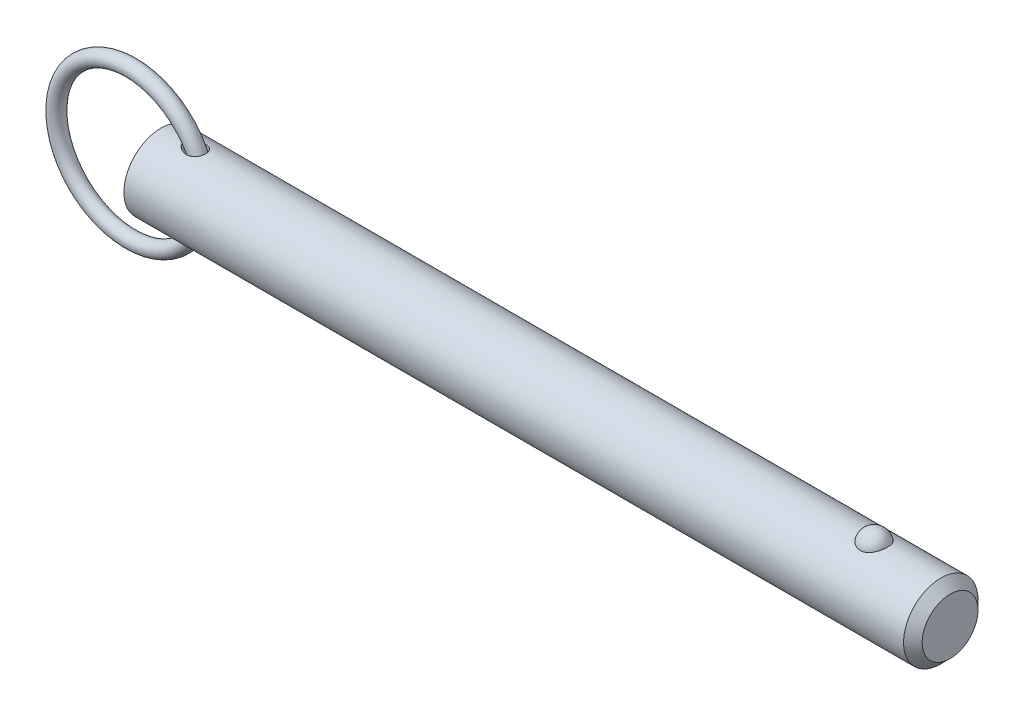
ISO-10303-21;
HEADER;
FILE_DESCRIPTION(('STEP AP214'),'2;1');
FILE_NAME('part.step','',(''),(''),'','','');
FILE_SCHEMA(('AUTOMOTIVE_DESIGN { 1 0 10303 214 1 1 1 1 }'));
ENDSEC;
DATA;
#1=APPLICATION_CONTEXT('core data for automotive mechanical design processes');
#2=APPLICATION_PROTOCOL_DEFINITION('international standard','automotive_design',2000,#1);
#3=PRODUCT_CONTEXT('',#1,'mechanical');
#4=PRODUCT('Part','Part','',(#3));
#5=PRODUCT_RELATED_PRODUCT_CATEGORY('part','',(#4));
#6=PRODUCT_DEFINITION_FORMATION('','',#4);
#7=PRODUCT_DEFINITION_CONTEXT('part definition',#1,'design');
#8=PRODUCT_DEFINITION('design','',#6,#7);
#9=PRODUCT_DEFINITION_SHAPE('','',#8);
#10=(LENGTH_UNIT() NAMED_UNIT(*) SI_UNIT(.MILLI.,.METRE.));
#11=(NAMED_UNIT(*) PLANE_ANGLE_UNIT() SI_UNIT($,.RADIAN.));
#12=(NAMED_UNIT(*) SI_UNIT($,.STERADIAN.) SOLID_ANGLE_UNIT());
#13=UNCERTAINTY_MEASURE_WITH_UNIT(LENGTH_MEASURE(1.E-05),#10,'distance_accuracy_value','');
#14=(GEOMETRIC_REPRESENTATION_CONTEXT(3) GLOBAL_UNCERTAINTY_ASSIGNED_CONTEXT((#13)) GLOBAL_UNIT_ASSIGNED_CONTEXT((#10,
#11,#12)) REPRESENTATION_CONTEXT('',''));
#15=CARTESIAN_POINT('',(0.,0.,0.));
#16=DIRECTION('',(0.,0.,1.));
#17=DIRECTION('',(1.,0.,0.));
#18=AXIS2_PLACEMENT_3D('',#15,#16,#17);
#19=CARTESIAN_POINT('',(-6.46799987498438,0.,0.));
#20=DIRECTION('',(0.,0.,1.));
#21=DIRECTION('',(1.,0.,0.));
#22=AXIS2_PLACEMENT_3D('',#19,#20,#21);
#23=TOROIDAL_SURFACE('',#22,15.875,1.588);
#24=CARTESIAN_POINT('',(10.9950001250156,0.,0.));
#25=VERTEX_POINT('',#24);
#26=VERTEX_LOOP('',#25);
#27=FACE_BOUND('',#26,.T.);
#28=ADVANCED_FACE('P0_F12',(#27),#23,.T.);
#29=CLOSED_SHELL('',(#28));
#30=MANIFOLD_SOLID_BREP('P0_B1',#29);
#31=CARTESIAN_POINT('',(0.,0.,0.));
#32=DIRECTION('',(1.,0.,0.));
#33=DIRECTION('',(0.,0.,-1.));
#34=AXIS2_PLACEMENT_3D('',#31,#32,#33);
#35=CYLINDRICAL_SURFACE('',#34,7.94);
#36=CARTESIAN_POINT('',(5.37881269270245,7.8641200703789,-1.0950869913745));
#37=CARTESIAN_POINT('',(5.49078530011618,7.84653010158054,-1.22142628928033));
#38=CARTESIAN_POINT('',(5.61742164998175,7.82766483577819,-1.33478448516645));
#39=CARTESIAN_POINT('',(5.82155225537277,7.80005811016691,-1.48501770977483));
#40=CARTESIAN_POINT('',(5.89211597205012,7.79095331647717,-1.53186949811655));
#41=CARTESIAN_POINT('',(6.03726296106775,7.77331484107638,-1.61899652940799));
#42=CARTESIAN_POINT('',(6.11184478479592,7.76478095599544,-1.65927412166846));
#43=CARTESIAN_POINT('',(6.31831542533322,7.74290334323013,-1.75933205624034));
#44=CARTESIAN_POINT('',(6.45343253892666,7.73042593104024,-1.81276183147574));
#45=CARTESIAN_POINT('',(6.73017339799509,7.70966096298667,-1.89912673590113));
#46=CARTESIAN_POINT('',(6.87179099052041,7.70136953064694,-1.93208083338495));
#47=CARTESIAN_POINT('',(7.17522096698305,7.6896684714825,-1.97820987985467));
#48=CARTESIAN_POINT('',(7.33750100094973,7.68691980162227,-1.98871513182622));
#49=CARTESIAN_POINT('',(7.57994245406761,7.68880305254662,-1.98137951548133));
#50=CARTESIAN_POINT('',(7.66059155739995,7.69043175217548,-1.97508575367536));
#51=CARTESIAN_POINT('',(7.82077465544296,7.69570110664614,-1.95445819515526));
#52=CARTESIAN_POINT('',(7.9003091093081,7.69934090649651,-1.94012781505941));
#53=CARTESIAN_POINT('',(8.09280087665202,7.71066069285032,-1.89475688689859));
#54=CARTESIAN_POINT('',(8.20465204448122,7.71942251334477,-1.85909462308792));
#55=CARTESIAN_POINT('',(8.42059371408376,7.74035594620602,-1.7699066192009));
#56=CARTESIAN_POINT('',(8.52468939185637,7.75252525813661,-1.7163929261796));
#57=CARTESIAN_POINT('',(8.72211003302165,7.77903750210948,-1.59192358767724));
#58=CARTESIAN_POINT('',(8.81539818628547,7.79338749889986,-1.52091076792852));
#59=CARTESIAN_POINT('',(8.98759177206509,7.8225086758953,-1.36321590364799));
#60=CARTESIAN_POINT('',(9.06649712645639,7.83727985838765,-1.27653377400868));
#61=CARTESIAN_POINT('',(9.20311499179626,7.86453692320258,-1.09567667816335));
#62=CARTESIAN_POINT('',(9.26180839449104,7.8771064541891,-1.00225329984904));
#63=CARTESIAN_POINT('',(9.36257622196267,7.89954213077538,-0.8065472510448));
#64=CARTESIAN_POINT('',(9.40465301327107,7.9094086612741,-0.704265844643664));
#65=CARTESIAN_POINT('',(9.47062404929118,7.92520709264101,-0.495461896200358));
#66=CARTESIAN_POINT('',(9.49478817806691,7.9311972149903,-0.389028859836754));
#67=CARTESIAN_POINT('',(9.52544004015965,7.93883641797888,-0.173494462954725));
#68=CARTESIAN_POINT('',(9.5319278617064,7.94048552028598,-0.0643931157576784));
#69=CARTESIAN_POINT('',(9.52707996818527,7.93926454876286,0.153487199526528));
#70=CARTESIAN_POINT('',(9.51572796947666,7.93639034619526,0.26226578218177));
#71=CARTESIAN_POINT('',(9.47542322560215,7.92642470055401,0.476313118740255));
#72=CARTESIAN_POINT('',(9.44647056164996,7.91933327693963,0.581581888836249));
#73=CARTESIAN_POINT('',(9.3716401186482,7.90170355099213,0.785602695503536));
#74=CARTESIAN_POINT('',(9.32576415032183,7.89116561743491,0.884355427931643));
#75=CARTESIAN_POINT('',(9.21823065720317,7.8677977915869,1.07254831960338));
#76=CARTESIAN_POINT('',(9.15657431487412,7.85496807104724,1.16198917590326));
#77=CARTESIAN_POINT('',(9.01919194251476,7.82843688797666,1.32903649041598));
#78=CARTESIAN_POINT('',(8.94347744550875,7.81473614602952,1.40665255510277));
#79=CARTESIAN_POINT('',(8.78012086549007,7.7879321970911,1.5481977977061));
#80=CARTESIAN_POINT('',(8.69247914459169,7.77482897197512,1.61212739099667));
#81=CARTESIAN_POINT('',(8.50642314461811,7.75037063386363,1.72592270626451));
#82=CARTESIAN_POINT('',(8.40786430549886,7.73904540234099,1.77555777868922));
#83=CARTESIAN_POINT('',(8.2039870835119,7.71943979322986,1.85894844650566));
#84=CARTESIAN_POINT('',(8.0986670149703,7.7111601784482,1.89270006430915));
#85=CARTESIAN_POINT('',(7.87703213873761,7.69782475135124,1.94625652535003));
#86=CARTESIAN_POINT('',(7.76044899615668,7.69301557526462,1.96500324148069));
#87=CARTESIAN_POINT('',(7.52574256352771,7.68770484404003,1.98567257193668));
#88=CARTESIAN_POINT('',(7.40761868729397,7.68720497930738,1.98758858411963));
#89=CARTESIAN_POINT('',(7.15639592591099,7.69044495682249,1.97502233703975));
#90=CARTESIAN_POINT('',(7.02341871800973,7.69476380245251,1.9583009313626));
#91=CARTESIAN_POINT('',(6.7612589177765,7.70776394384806,1.90648094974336));
#92=CARTESIAN_POINT('',(6.6320804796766,7.71644984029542,1.87136299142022));
#93=CARTESIAN_POINT('',(6.35978215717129,7.73875442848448,1.77707737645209));
#94=CARTESIAN_POINT('',(6.2177212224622,7.75293863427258,1.71496895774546));
#95=CARTESIAN_POINT('',(5.94559201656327,7.78383102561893,1.56880760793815));
#96=CARTESIAN_POINT('',(5.81552062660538,7.80053855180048,1.48476040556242));
#97=CARTESIAN_POINT('',(5.60081087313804,7.83035955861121,1.31701356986));
#98=CARTESIAN_POINT('',(5.51265224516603,7.84340226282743,1.23780647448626));
#99=CARTESIAN_POINT('',(5.34976240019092,7.86852524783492,1.06647953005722));
#100=CARTESIAN_POINT('',(5.27500719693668,7.88060722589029,0.974383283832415));
#101=CARTESIAN_POINT('',(5.15877594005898,7.89990441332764,0.800548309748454));
#102=CARTESIAN_POINT('',(5.11360209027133,7.90759876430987,0.721348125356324));
#103=CARTESIAN_POINT('',(5.03655060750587,7.92090267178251,0.556518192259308));
#104=CARTESIAN_POINT('',(5.00466157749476,7.92651401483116,0.470894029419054));
#105=CARTESIAN_POINT('',(4.95653766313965,7.93503671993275,0.294356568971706));
#106=CARTESIAN_POINT('',(4.94043621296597,7.93792505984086,0.203404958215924));
#107=CARTESIAN_POINT('',(4.92605720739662,7.94050250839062,0.0200631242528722));
#108=CARTESIAN_POINT('',(4.92776929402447,7.9401934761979,-0.072326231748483));
#109=CARTESIAN_POINT('',(4.94742735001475,7.93667454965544,-0.24325091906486));
#110=CARTESIAN_POINT('',(4.96327131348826,7.93384031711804,-0.32204819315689));
#111=CARTESIAN_POINT('',(5.00707570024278,7.92609115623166,-0.47605810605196));
#112=CARTESIAN_POINT('',(5.0350396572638,7.92117562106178,-0.551269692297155));
#113=CARTESIAN_POINT('',(5.10737112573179,7.90866290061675,-0.70999547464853));
#114=CARTESIAN_POINT('',(5.15379379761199,7.90074105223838,-0.792541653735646));
#115=CARTESIAN_POINT('',(5.2582083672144,7.88338732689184,-0.949781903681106));
#116=CARTESIAN_POINT('',(5.31621941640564,7.87395295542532,-1.02446265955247));
#117=CARTESIAN_POINT('',(5.37881269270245,7.8641200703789,-1.0950869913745));
#118=B_SPLINE_CURVE_WITH_KNOTS('',3,(#36,#37,#38,#39,#40,#41,#42,#43,#44,#45,#46,#47,#48,#49,
#50,#51,#52,#53,#54,#55,#56,#57,#58,#59,#60,#61,#62,#63,#64,#65,#66,#67,#68,#69,#70,#71,#72,#73,
#74,#75,#76,#77,#78,#79,#80,#81,#82,#83,#84,#85,#86,#87,#88,#89,#90,#91,#92,#93,#94,#95,#96,#97,
#98,#99,#100,#101,#102,#103,#104,#105,#106,#107,#108,#109,#110,#111,#112,#113,#114,#115,#116,
#117),.UNSPECIFIED.,.T.,.F.,(4,2,2,2,2,2,2,2,2,2,2,2,2,2,2,2,2,2,2,2,2,2,2,2,2,2,2,2,2,2,2,2,2,
2,2,2,2,2,2,2,4),(0.,0.508599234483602,0.763935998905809,1.01918131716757,1.45492798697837,
1.89027038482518,2.37502798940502,2.61739702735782,2.8596631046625,3.21120678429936,
3.56251370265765,3.91498401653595,4.26745624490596,4.59897839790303,4.93045331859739,
5.2568264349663,5.58319792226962,5.909867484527,6.23653553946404,6.56316865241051,
6.88977729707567,7.21611917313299,7.54245114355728,7.87378632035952,8.20520442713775,
8.55832700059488,8.91158808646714,9.31234018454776,9.71351536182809,10.1786231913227,
10.6436096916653,11.0001264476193,11.3559986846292,11.6294791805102,11.9027245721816,
12.1782599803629,12.4536351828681,12.693828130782,12.9340911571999,13.2179277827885,
13.5022374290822),.UNSPECIFIED.);
#119=CARTESIAN_POINT('',(5.37881269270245,7.8641200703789,-1.0950869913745));
#120=VERTEX_POINT('',#119);
#121=EDGE_CURVE('P1_E40',#120,#120,#118,.T.);
#122=ORIENTED_EDGE('',*,*,#121,.T.);
#123=EDGE_LOOP('',(#122));
#124=FACE_BOUND('',#123,.T.);
#125=CARTESIAN_POINT('',(166.295,0.,0.));
#126=DIRECTION('',(1.,0.,0.));
#127=DIRECTION('',(0.,0.,-1.));
#128=AXIS2_PLACEMENT_3D('',#125,#126,#127);
#129=CIRCLE('',#128,7.94);
#130=CARTESIAN_POINT('',(166.295,0.,-7.94));
#131=VERTEX_POINT('',#130);
#132=EDGE_CURVE('P1_E25',#131,#131,#129,.T.);
#133=ORIENTED_EDGE('',*,*,#132,.F.);
#134=EDGE_LOOP('',(#133));
#135=FACE_BOUND('',#134,.T.);
#136=CARTESIAN_POINT('',(0.,0.,0.));
#137=DIRECTION('',(1.,0.,0.));
#138=DIRECTION('',(0.,0.,-1.));
#139=AXIS2_PLACEMENT_3D('',#136,#137,#138);
#140=CIRCLE('',#139,7.94);
#141=CARTESIAN_POINT('',(0.,0.,-7.94));
#142=VERTEX_POINT('',#141);
#143=EDGE_CURVE('P1_E9',#142,#142,#140,.T.);
#144=ORIENTED_EDGE('',*,*,#143,.T.);
#145=EDGE_LOOP('',(#144));
#146=FACE_BOUND('',#145,.T.);
#147=CARTESIAN_POINT('',(152.064907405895,7.37767842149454,2.93486986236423));
#148=CARTESIAN_POINT('',(151.912749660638,7.3776732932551,2.93487505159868));
#149=CARTESIAN_POINT('',(151.760632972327,7.38258419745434,2.92262454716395));
#150=CARTESIAN_POINT('',(151.460928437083,7.40163229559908,2.87404196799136));
#151=CARTESIAN_POINT('',(151.313339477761,7.41576720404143,2.83771585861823));
#152=CARTESIAN_POINT('',(151.027018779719,7.45161576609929,2.74218769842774));
#153=CARTESIAN_POINT('',(150.888274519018,7.47331841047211,2.68301886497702));
#154=CARTESIAN_POINT('',(150.622882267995,7.52194082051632,2.54350967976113));
#155=CARTESIAN_POINT('',(150.496236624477,7.54886159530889,2.46316523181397));
#156=CARTESIAN_POINT('',(150.254534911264,7.60594671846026,2.28090375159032));
#157=CARTESIAN_POINT('',(150.139906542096,7.63618114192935,2.1784421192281));
#158=CARTESIAN_POINT('',(149.928878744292,7.69614046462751,1.95608495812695));
#159=CARTESIAN_POINT('',(149.832482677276,7.72586526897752,1.83618622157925));
#160=CARTESIAN_POINT('',(149.655938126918,7.78314821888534,1.57628086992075));
#161=CARTESIAN_POINT('',(149.576707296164,7.81055035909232,1.43561546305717));
#162=CARTESIAN_POINT('',(149.441797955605,7.85879631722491,1.142363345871));
#163=CARTESIAN_POINT('',(149.386121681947,7.87963951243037,0.989775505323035));
#164=CARTESIAN_POINT('',(149.29881215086,7.91289645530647,0.674619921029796));
#165=CARTESIAN_POINT('',(149.26753090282,7.92518652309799,0.511941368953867));
#166=CARTESIAN_POINT('',(149.230975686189,7.93958930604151,0.18324773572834));
#167=CARTESIAN_POINT('',(149.225701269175,7.94170219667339,0.017232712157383));
#168=CARTESIAN_POINT('',(149.241231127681,7.93554931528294,-0.31267286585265));
#169=CARTESIAN_POINT('',(149.261925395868,7.92732732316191,-0.476569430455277));
#170=CARTESIAN_POINT('',(149.32878655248,7.90141534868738,-0.798305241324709));
#171=CARTESIAN_POINT('',(149.374953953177,7.88372517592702,-0.956144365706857));
#172=CARTESIAN_POINT('',(149.491898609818,7.84066230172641,-1.26152073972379));
#173=CARTESIAN_POINT('',(149.562704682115,7.81528060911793,-1.40904568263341));
#174=CARTESIAN_POINT('',(149.727478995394,7.75948672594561,-1.68950598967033));
#175=CARTESIAN_POINT('',(149.821448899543,7.72907417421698,-1.82244030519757));
#176=CARTESIAN_POINT('',(150.030839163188,7.66640424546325,-2.07032792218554));
#177=CARTESIAN_POINT('',(150.146315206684,7.63414223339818,-2.18523308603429));
#178=CARTESIAN_POINT('',(150.3959006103,7.57149681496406,-2.39329737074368));
#179=CARTESIAN_POINT('',(150.530008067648,7.54111321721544,-2.48645870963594));
#180=CARTESIAN_POINT('',(150.810111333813,7.48650742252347,-2.64628132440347));
#181=CARTESIAN_POINT('',(150.955760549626,7.46215900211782,-2.71350554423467));
#182=CARTESIAN_POINT('',(151.257425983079,7.42171253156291,-2.82226614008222));
#183=CARTESIAN_POINT('',(151.413438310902,7.40561140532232,-2.86381209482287));
#184=CARTESIAN_POINT('',(151.722970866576,7.3842679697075,-2.9183907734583));
#185=CARTESIAN_POINT('',(151.876222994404,7.37852109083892,-2.93275024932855));
#186=CARTESIAN_POINT('',(152.183070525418,7.37700973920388,-2.93655208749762));
#187=CARTESIAN_POINT('',(152.336665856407,7.38124333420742,-2.92599927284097));
#188=CARTESIAN_POINT('',(152.634990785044,7.39890635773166,-2.88102897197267));
#189=CARTESIAN_POINT('',(152.779848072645,7.41205491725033,-2.84733999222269));
#190=CARTESIAN_POINT('',(153.06164329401,7.445801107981,-2.75788206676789));
#191=CARTESIAN_POINT('',(153.198580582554,7.46639934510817,-2.70211132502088));
#192=CARTESIAN_POINT('',(153.464061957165,7.51339098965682,-2.56858908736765));
#193=CARTESIAN_POINT('',(153.592354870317,7.53990200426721,-2.4903806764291));
#194=CARTESIAN_POINT('',(153.834244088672,7.59569503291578,-2.31462737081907));
#195=CARTESIAN_POINT('',(153.947837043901,7.6249776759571,-2.21707808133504));
#196=CARTESIAN_POINT('',(154.16322156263,7.68489473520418,-1.99982049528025));
#197=CARTESIAN_POINT('',(154.264148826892,7.71552419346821,-1.87925337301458));
#198=CARTESIAN_POINT('',(154.445186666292,7.77353016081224,-1.6226882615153));
#199=CARTESIAN_POINT('',(154.525293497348,7.80090608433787,-1.48668750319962));
#200=CARTESIAN_POINT('',(154.665361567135,7.85047992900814,-1.1981841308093));
#201=CARTESIAN_POINT('',(154.724587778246,7.87248183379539,-1.04529016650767));
#202=CARTESIAN_POINT('',(154.817982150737,7.90785114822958,-0.731080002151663));
#203=CARTESIAN_POINT('',(154.852149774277,7.92121837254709,-0.56976362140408));
#204=CARTESIAN_POINT('',(154.894795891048,7.93797834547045,-0.242812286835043));
#205=CARTESIAN_POINT('',(154.903204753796,7.94134405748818,-0.0771668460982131));
#206=CARTESIAN_POINT('',(154.893962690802,7.93767937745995,0.253276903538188));
#207=CARTESIAN_POINT('',(154.876312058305,7.93064910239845,0.418075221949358));
#208=CARTESIAN_POINT('',(154.815424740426,7.90695571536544,0.741525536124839));
#209=CARTESIAN_POINT('',(154.772281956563,7.8903279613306,0.900197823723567));
#210=CARTESIAN_POINT('',(154.66135358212,7.84916386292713,1.20759654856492));
#211=CARTESIAN_POINT('',(154.59356656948,7.82462706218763,1.35632241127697));
#212=CARTESIAN_POINT('',(154.434371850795,7.7700669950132,1.64032869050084));
#213=CARTESIAN_POINT('',(154.342861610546,7.7400200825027,1.7755471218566));
#214=CARTESIAN_POINT('',(154.138296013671,7.67774175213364,2.0280064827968));
#215=CARTESIAN_POINT('',(154.025241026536,7.64551037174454,2.14524772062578));
#216=CARTESIAN_POINT('',(153.780831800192,7.58265895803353,2.35778002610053));
#217=CARTESIAN_POINT('',(153.649583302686,7.5520309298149,2.45319004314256));
#218=CARTESIAN_POINT('',(153.371601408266,7.49579792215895,2.61999897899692));
#219=CARTESIAN_POINT('',(153.224867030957,7.47019326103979,2.69139637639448));
#220=CARTESIAN_POINT('',(152.912947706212,7.42622216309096,2.8105324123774));
#221=CARTESIAN_POINT('',(152.747220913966,7.40825002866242,2.85700910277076));
#222=CARTESIAN_POINT('',(152.409279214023,7.38398348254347,2.9191685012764));
#223=CARTESIAN_POINT('',(152.23706702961,7.3776842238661,2.93486399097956));
#224=CARTESIAN_POINT('',(152.064907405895,7.37767842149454,2.93486986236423));
#225=B_SPLINE_CURVE_WITH_KNOTS('',3,(#147,#148,#149,#150,#151,#152,#153,#154,#155,#156,#157,
#158,#159,#160,#161,#162,#163,#164,#165,#166,#167,#168,#169,#170,#171,#172,#173,#174,#175,#176,
#177,#178,#179,#180,#181,#182,#183,#184,#185,#186,#187,#188,#189,#190,#191,#192,#193,#194,#195,
#196,#197,#198,#199,#200,#201,#202,#203,#204,#205,#206,#207,#208,#209,#210,#211,#212,#213,#214,
#215,#216,#217,#218,#219,#220,#221,#222,#223,#224),.UNSPECIFIED.,.T.,.F.,(4,2,2,2,2,2,2,2,2,2,2,
2,2,2,2,2,2,2,2,2,2,2,2,2,2,2,2,2,2,2,2,2,2,2,2,2,2,2,4),(0.,0.455841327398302,
0.911569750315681,1.36663794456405,1.82179423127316,2.28978983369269,2.75787163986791,
3.24685368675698,3.73588214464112,4.23184282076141,4.72779494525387,5.22165321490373,
5.71552141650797,6.2099691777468,6.7044524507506,7.20023431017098,7.69596557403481,
8.18023418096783,8.66432203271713,9.1241069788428,9.58380291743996,10.0296503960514,
10.4755341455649,10.9312349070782,11.3870393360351,11.8654416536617,12.3439299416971,
12.8378875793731,13.3318558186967,13.8271581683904,14.3224549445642,14.8159385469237,
15.3094506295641,15.8051323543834,16.3008055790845,16.7937101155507,17.2866458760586,
17.8026240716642,18.3183879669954),.UNSPECIFIED.);
#226=CARTESIAN_POINT('',(152.064907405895,7.37767842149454,2.93486986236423));
#227=VERTEX_POINT('',#226);
#228=EDGE_CURVE('P1_E34',#227,#227,#225,.T.);
#229=ORIENTED_EDGE('',*,*,#228,.T.);
#230=EDGE_LOOP('',(#229));
#231=FACE_BOUND('',#230,.T.);
#232=CARTESIAN_POINT('',(5.37881269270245,-7.8641200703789,-1.0950869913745));
#233=CARTESIAN_POINT('',(5.31532711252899,-7.87409326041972,-1.02345575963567));
#234=CARTESIAN_POINT('',(5.25654962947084,-7.88365715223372,-0.947641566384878));
#235=CARTESIAN_POINT('',(5.15093536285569,-7.90122221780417,-0.787865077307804));
#236=CARTESIAN_POINT('',(5.10408931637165,-7.90922460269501,-0.703909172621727));
#237=CARTESIAN_POINT('',(5.02499142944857,-7.92292057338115,-0.527991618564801));
#238=CARTESIAN_POINT('',(4.99290048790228,-7.92858863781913,-0.435954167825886));
#239=CARTESIAN_POINT('',(4.94718343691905,-7.93670712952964,-0.247266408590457));
#240=CARTESIAN_POINT('',(4.93353142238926,-7.93916207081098,-0.150622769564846));
#241=CARTESIAN_POINT('',(4.92669426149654,-7.94038957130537,0.0306459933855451));
#242=CARTESIAN_POINT('',(4.93105622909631,-7.93960347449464,0.115182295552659));
#243=CARTESIAN_POINT('',(4.95441758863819,-7.93542535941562,0.282133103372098));
#244=CARTESIAN_POINT('',(4.97342060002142,-7.93203269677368,0.364547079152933));
#245=CARTESIAN_POINT('',(5.02337664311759,-7.92322764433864,0.521528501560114));
#246=CARTESIAN_POINT('',(5.05377582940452,-7.91790920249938,0.596281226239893));
#247=CARTESIAN_POINT('',(5.1246872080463,-7.90571364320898,0.740640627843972));
#248=CARTESIAN_POINT('',(5.16520358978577,-7.89883588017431,0.81024515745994));
#249=CARTESIAN_POINT('',(5.27792634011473,-7.88012470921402,0.978620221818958));
#250=CARTESIAN_POINT('',(5.35563200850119,-7.86757912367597,1.07363778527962));
#251=CARTESIAN_POINT('',(5.52523836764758,-7.84150676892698,1.24994147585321));
#252=CARTESIAN_POINT('',(5.61717506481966,-7.82797755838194,1.33119164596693));
#253=CARTESIAN_POINT('',(5.8391371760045,-7.79742756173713,1.50104748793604));
#254=CARTESIAN_POINT('',(5.9725742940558,-7.78050347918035,1.58521567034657));
#255=CARTESIAN_POINT('',(6.25160600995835,-7.74942135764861,1.73078109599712));
#256=CARTESIAN_POINT('',(6.39720857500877,-7.73526515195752,1.79216327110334));
#257=CARTESIAN_POINT('',(6.69793322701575,-7.7116170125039,1.89134478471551));
#258=CARTESIAN_POINT('',(6.85312134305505,-7.70216275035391,1.92895428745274));
#259=CARTESIAN_POINT('',(7.16781951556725,-7.68988337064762,1.97736316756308));
#260=CARTESIAN_POINT('',(7.32732244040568,-7.68704791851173,1.98820434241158));
#261=CARTESIAN_POINT('',(7.61290770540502,-7.68890797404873,1.98097687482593));
#262=CARTESIAN_POINT('',(7.73913797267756,-7.69217875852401,1.96837928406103));
#263=CARTESIAN_POINT('',(7.98774248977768,-7.70364253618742,1.92303262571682));
#264=CARTESIAN_POINT('',(8.11011880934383,-7.71183283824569,1.89029457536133));
#265=CARTESIAN_POINT('',(8.34766306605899,-7.73253074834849,1.80375920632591));
#266=CARTESIAN_POINT('',(8.46278682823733,-7.74506226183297,1.74984505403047));
#267=CARTESIAN_POINT('',(8.6806268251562,-7.77294147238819,1.62149891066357));
#268=CARTESIAN_POINT('',(8.78334736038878,-7.78828818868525,1.54707406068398));
#269=CARTESIAN_POINT('',(8.96275951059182,-7.81808719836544,1.38814746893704));
#270=CARTESIAN_POINT('',(9.0410292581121,-7.83247448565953,1.30540890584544));
#271=CARTESIAN_POINT('',(9.18176824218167,-7.86008608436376,1.12727331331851));
#272=CARTESIAN_POINT('',(9.24424163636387,-7.87331070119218,1.03187962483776));
#273=CARTESIAN_POINT('',(9.34924815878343,-7.89649032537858,0.835684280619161));
#274=CARTESIAN_POINT('',(9.39252490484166,-7.90656172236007,0.735293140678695));
#275=CARTESIAN_POINT('',(9.46188913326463,-7.92307290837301,0.528458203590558));
#276=CARTESIAN_POINT('',(9.48797767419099,-7.92951292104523,0.422014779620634));
#277=CARTESIAN_POINT('',(9.5222867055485,-7.93804067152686,0.20658939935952));
#278=CARTESIAN_POINT('',(9.53058328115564,-7.94014694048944,0.0976202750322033));
#279=CARTESIAN_POINT('',(9.52935292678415,-7.93983698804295,-0.120212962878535));
#280=CARTESIAN_POINT('',(9.51982577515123,-7.93742071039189,-0.229077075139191));
#281=CARTESIAN_POINT('',(9.48313466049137,-7.92831916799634,-0.44375138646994));
#282=CARTESIAN_POINT('',(9.45594838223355,-7.92162850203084,-0.549557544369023));
#283=CARTESIAN_POINT('',(9.3845465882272,-7.90469917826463,-0.754954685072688));
#284=CARTESIAN_POINT('',(9.34033171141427,-7.89446065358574,-0.854545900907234));
#285=CARTESIAN_POINT('',(9.23602927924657,-7.87157146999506,-1.04456732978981));
#286=CARTESIAN_POINT('',(9.17596171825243,-7.85892385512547,-1.13500888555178));
#287=CARTESIAN_POINT('',(9.04153430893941,-7.83259746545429,-1.30436780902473));
#288=CARTESIAN_POINT('',(8.96717562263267,-7.81891877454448,-1.38328611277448));
#289=CARTESIAN_POINT('',(8.80603455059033,-7.79196869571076,-1.52782923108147));
#290=CARTESIAN_POINT('',(8.71921490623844,-7.77869867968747,-1.59341269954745));
#291=CARTESIAN_POINT('',(8.53589430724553,-7.7539823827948,-1.7096493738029));
#292=CARTESIAN_POINT('',(8.439392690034,-7.74253622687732,-1.76030155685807));
#293=CARTESIAN_POINT('',(8.23614706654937,-7.72219212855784,-1.84754820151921));
#294=CARTESIAN_POINT('',(8.12916866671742,-7.71339202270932,-1.88361685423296));
#295=CARTESIAN_POINT('',(7.91082287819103,-7.69955300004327,-1.93940887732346));
#296=CARTESIAN_POINT('',(7.79945379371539,-7.69451555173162,-1.95912586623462));
#297=CARTESIAN_POINT('',(7.56409927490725,-7.6881073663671,-1.98413612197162));
#298=CARTESIAN_POINT('',(7.43993744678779,-7.68713944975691,-1.98784574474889));
#299=CARTESIAN_POINT('',(7.19239878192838,-7.68969629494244,-1.97792309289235));
#300=CARTESIAN_POINT('',(7.06902225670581,-7.69322274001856,-1.96428432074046));
#301=CARTESIAN_POINT('',(6.80624991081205,-7.70498367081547,-1.91768089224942));
#302=CARTESIAN_POINT('',(6.66736121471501,-7.71386737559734,-1.88203087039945));
#303=CARTESIAN_POINT('',(6.39625444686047,-7.73551250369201,-1.79098714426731));
#304=CARTESIAN_POINT('',(6.26404857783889,-7.74828074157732,-1.73555871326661));
#305=CARTESIAN_POINT('',(6.06559048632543,-7.77003865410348,-1.63446133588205));
#306=CARTESIAN_POINT('',(5.99591479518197,-7.77821880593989,-1.59522999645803));
#307=CARTESIAN_POINT('',(5.86025875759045,-7.79503524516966,-1.51091846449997));
#308=CARTESIAN_POINT('',(5.79427944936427,-7.8036716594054,-1.46583664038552));
#309=CARTESIAN_POINT('',(5.60322733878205,-7.82978128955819,-1.3219827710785));
#310=CARTESIAN_POINT('',(5.48449649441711,-7.84751780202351,-1.21433077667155));
#311=CARTESIAN_POINT('',(5.37881269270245,-7.8641200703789,-1.0950869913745));
#312=B_SPLINE_CURVE_WITH_KNOTS('',3,(#232,#233,#234,#235,#236,#237,#238,#239,#240,#241,#242,
#243,#244,#245,#246,#247,#248,#249,#250,#251,#252,#253,#254,#255,#256,#257,#258,#259,#260,#261,
#262,#263,#264,#265,#266,#267,#268,#269,#270,#271,#272,#273,#274,#275,#276,#277,#278,#279,#280,
#281,#282,#283,#284,#285,#286,#287,#288,#289,#290,#291,#292,#293,#294,#295,#296,#297,#298,#299,
#300,#301,#302,#303,#304,#305,#306,#307,#308,#309,#310,#311),.UNSPECIFIED.,.T.,.F.,(4,2,2,2,2,2,
2,2,2,2,2,2,2,2,2,2,2,2,2,2,2,2,2,2,2,2,2,2,2,2,2,2,2,2,2,2,2,2,2,4),(0.,0.288363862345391,
0.576503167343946,0.867714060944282,1.15851540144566,1.41111828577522,1.66378363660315,
1.90549406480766,2.1473047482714,2.51540453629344,2.88445136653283,3.35805159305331,
3.83196445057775,4.30961543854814,4.78652012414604,5.16565662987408,5.54458592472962,
5.92563591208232,6.30655339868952,6.64920782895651,6.99177197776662,7.31956587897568,
7.64733959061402,7.97370879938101,8.30008206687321,8.62686856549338,8.95364280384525,
9.28000684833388,9.60634436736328,9.93367879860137,10.261035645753,10.59932199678,
10.9377403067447,11.308967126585,11.6803330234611,12.1096921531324,12.5398088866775,
12.7806650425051,13.0215885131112,13.5016249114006),.UNSPECIFIED.);
#313=CARTESIAN_POINT('',(5.37881269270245,-7.8641200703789,-1.0950869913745));
#314=VERTEX_POINT('',#313);
#315=EDGE_CURVE('P1_E17',#314,#314,#312,.T.);
#316=ORIENTED_EDGE('',*,*,#315,.T.);
#317=EDGE_LOOP('',(#316));
#318=FACE_BOUND('',#317,.T.);
#319=ADVANCED_FACE('P1_F13',(#124,#135,#146,#231,#318),#35,.T.);
#320=CARTESIAN_POINT('',(0.,0.,0.));
#321=DIRECTION('',(-1.,0.,0.));
#322=DIRECTION('',(0.,0.,1.));
#323=AXIS2_PLACEMENT_3D('',#320,#321,#322);
#324=PLANE('',#323);
#325=ORIENTED_EDGE('',*,*,#143,.F.);
#326=EDGE_LOOP('',(#325));
#327=FACE_BOUND('',#326,.T.);
#328=ADVANCED_FACE('P1_F15',(#327),#324,.T.);
#329=CARTESIAN_POINT('',(168.28,0.,0.));
#330=DIRECTION('',(-1.,0.,0.));
#331=DIRECTION('',(0.,0.,1.));
#332=AXIS2_PLACEMENT_3D('',#329,#330,#331);
#333=CONICAL_SURFACE('',#332,5.95500000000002,0.785398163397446);
#334=ORIENTED_EDGE('',*,*,#132,.T.);
#335=EDGE_LOOP('',(#334));
#336=FACE_BOUND('',#335,.T.);
#337=CARTESIAN_POINT('',(168.28,0.,0.));
#338=DIRECTION('',(1.,0.,0.));
#339=DIRECTION('',(0.,0.,-1.));
#340=AXIS2_PLACEMENT_3D('',#337,#338,#339);
#341=CIRCLE('',#340,5.95500000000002);
#342=CARTESIAN_POINT('',(168.28,0.,-5.95500000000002));
#343=VERTEX_POINT('',#342);
#344=EDGE_CURVE('P1_E30',#343,#343,#341,.T.);
#345=ORIENTED_EDGE('',*,*,#344,.F.);
#346=EDGE_LOOP('',(#345));
#347=FACE_BOUND('',#346,.T.);
#348=ADVANCED_FACE('P1_F55',(#336,#347),#333,.T.);
#349=CARTESIAN_POINT('',(168.28,5.95500000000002,0.));
#350=DIRECTION('',(1.,0.,0.));
#351=DIRECTION('',(0.,0.,-1.));
#352=AXIS2_PLACEMENT_3D('',#349,#350,#351);
#353=PLANE('',#352);
#354=ORIENTED_EDGE('',*,*,#344,.T.);
#355=EDGE_LOOP('',(#354));
#356=FACE_BOUND('',#355,.T.);
#357=ADVANCED_FACE('P1_F51',(#356),#353,.T.);
#358=CARTESIAN_POINT('',(152.064907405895,7.146,0.));
#359=DIRECTION('',(-1.,0.,0.));
#360=DIRECTION('',(0.,1.,0.));
#361=AXIS2_PLACEMENT_3D('',#358,#359,#360);
#362=SPHERICAL_SURFACE('',#361,2.944);
#363=ORIENTED_EDGE('',*,*,#228,.F.);
#364=EDGE_LOOP('',(#363));
#365=FACE_BOUND('',#364,.T.);
#366=ADVANCED_FACE('P1_F46',(#365),#362,.T.);
#367=CARTESIAN_POINT('',(-6.46799987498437,0.,0.));
#368=DIRECTION('',(0.,0.,1.));
#369=DIRECTION('',(1.,0.,0.));
#370=AXIS2_PLACEMENT_3D('',#367,#368,#369);
#371=TOROIDAL_SURFACE('',#370,15.875,1.985);
#372=ORIENTED_EDGE('',*,*,#315,.F.);
#373=EDGE_LOOP('',(#372));
#374=FACE_BOUND('',#373,.T.);
#375=ORIENTED_EDGE('',*,*,#121,.F.);
#376=EDGE_LOOP('',(#375));
#377=FACE_BOUND('',#376,.T.);
#378=ADVANCED_FACE('P1_F50',(#374,#377),#371,.F.);
#379=CLOSED_SHELL('',(#319,#328,#348,#357,#366,#378));
#380=MANIFOLD_SOLID_BREP('P1_B1',#379);
#381=ADVANCED_BREP_SHAPE_REPRESENTATION('',(#18,#30,#380),#14);
#382=SHAPE_DEFINITION_REPRESENTATION(#9,#381);
ENDSEC;
END-ISO-10303-21;
